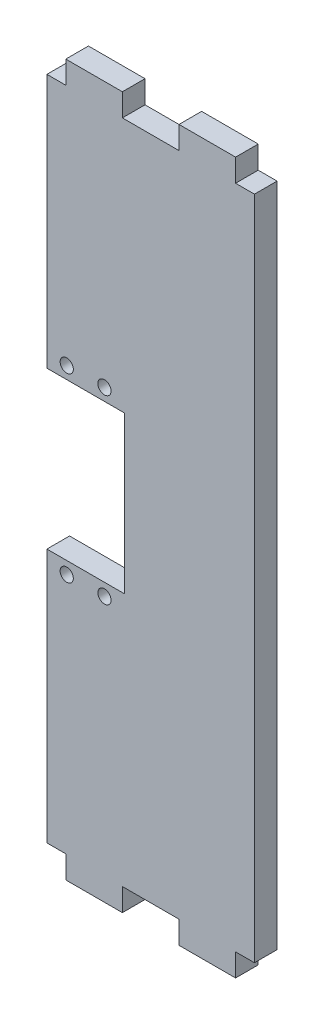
from build123d import *

# Parameters (mm, degrees)
CROQUIS1_W                   = 55
CROQUIS1_H                   = 176.4
SALIENTE_EXTRUIR1_DEPTH      = 6
SALIENTE_EXTRUIR2_DEPTH      = 6
SALIENTE_EXTRUIR2_DEPTH_BACK = 182.4
CROQUIS2_W                   = 15
CROQUIS2_H                   = 6
CROQUIS3_W                   = 20.5
CROQUIS3_H                   = 41.5
CORTAR_EXTRUIR1_DEPTH        = 6
CORTAR_EXTRUIR2_REACH        = 100.315
CROQUIS4_R                   = 1.75


with BuildPart() as part:
    # Croquis1 → Saliente-Extruir1 (new body)
    with BuildSketch(Plane.XY):
        Rectangle(CROQUIS1_W, CROQUIS1_H)
    extrude(amount=SALIENTE_EXTRUIR1_DEPTH)

    # Croquis2 → Saliente-Extruir2 (add, two sides: drawn at the far end of the back side and taken through both)
    with BuildSketch(Plane.XZ.offset(88.2).offset(-SALIENTE_EXTRUIR2_DEPTH_BACK)):
        with Locations((-15, 3)):
            Rectangle(CROQUIS2_W, CROQUIS2_H)
        with Locations((15, 3)):
            Rectangle(CROQUIS2_W, CROQUIS2_H)
    extrude(amount=SALIENTE_EXTRUIR2_DEPTH + SALIENTE_EXTRUIR2_DEPTH_BACK)

    # Croquis3 → Cortar-Extruir1 (cut)
    with BuildSketch(Plane.XY.offset(6)):
        with Locations((-17.25, 0)):
            Rectangle(CROQUIS3_W, CROQUIS3_H)
    extrude(amount=-CORTAR_EXTRUIR1_DEPTH, mode=Mode.SUBTRACT)

    # Croquis4 → Cortar-Extruir2 (cut, up to next)
    with BuildSketch(Plane.XY.offset(6), mode=Mode.PRIVATE) as cortar_extruir2_sk1:
        with Locations((-22.25, 24)):
            Circle(CROQUIS4_R)
    cortar_extruir2_tool1 = extrude(cortar_extruir2_sk1.sketch, amount=-CORTAR_EXTRUIR2_REACH, mode=Mode.PRIVATE) & part.part
    # Croquis4 → Cortar-Extruir2 (cut, up to next)
    with BuildSketch(Plane.XY.offset(6), mode=Mode.PRIVATE) as cortar_extruir2_sk2:
        with Locations((-22.25, -24)):
            Circle(CROQUIS4_R)
    cortar_extruir2_tool2 = extrude(cortar_extruir2_sk2.sketch, amount=-CORTAR_EXTRUIR2_REACH, mode=Mode.PRIVATE) & part.part
    # Croquis4 → Cortar-Extruir2 (cut, up to next)
    with BuildSketch(Plane.XY.offset(6), mode=Mode.PRIVATE) as cortar_extruir2_sk3:
        with Locations((-12.25, -24)):
            Circle(CROQUIS4_R)
    cortar_extruir2_tool3 = extrude(cortar_extruir2_sk3.sketch, amount=-CORTAR_EXTRUIR2_REACH, mode=Mode.PRIVATE) & part.part
    # Croquis4 → Cortar-Extruir2 (cut, up to next)
    with BuildSketch(Plane.XY.offset(6), mode=Mode.PRIVATE) as cortar_extruir2_sk4:
        with Locations((-12.25, 24)):
            Circle(CROQUIS4_R)
    cortar_extruir2_tool4 = extrude(cortar_extruir2_sk4.sketch, amount=-CORTAR_EXTRUIR2_REACH, mode=Mode.PRIVATE) & part.part
    add(cortar_extruir2_tool1.solids().sort_by_distance((-22.25, 24, 6))[0], mode=Mode.SUBTRACT)
    add(cortar_extruir2_tool2.solids().sort_by_distance((-22.25, -24, 6))[0], mode=Mode.SUBTRACT)
    add(cortar_extruir2_tool3.solids().sort_by_distance((-12.25, -24, 6))[0], mode=Mode.SUBTRACT)
    add(cortar_extruir2_tool4.solids().sort_by_distance((-12.25, 24, 6))[0], mode=Mode.SUBTRACT)


solid = part.part
